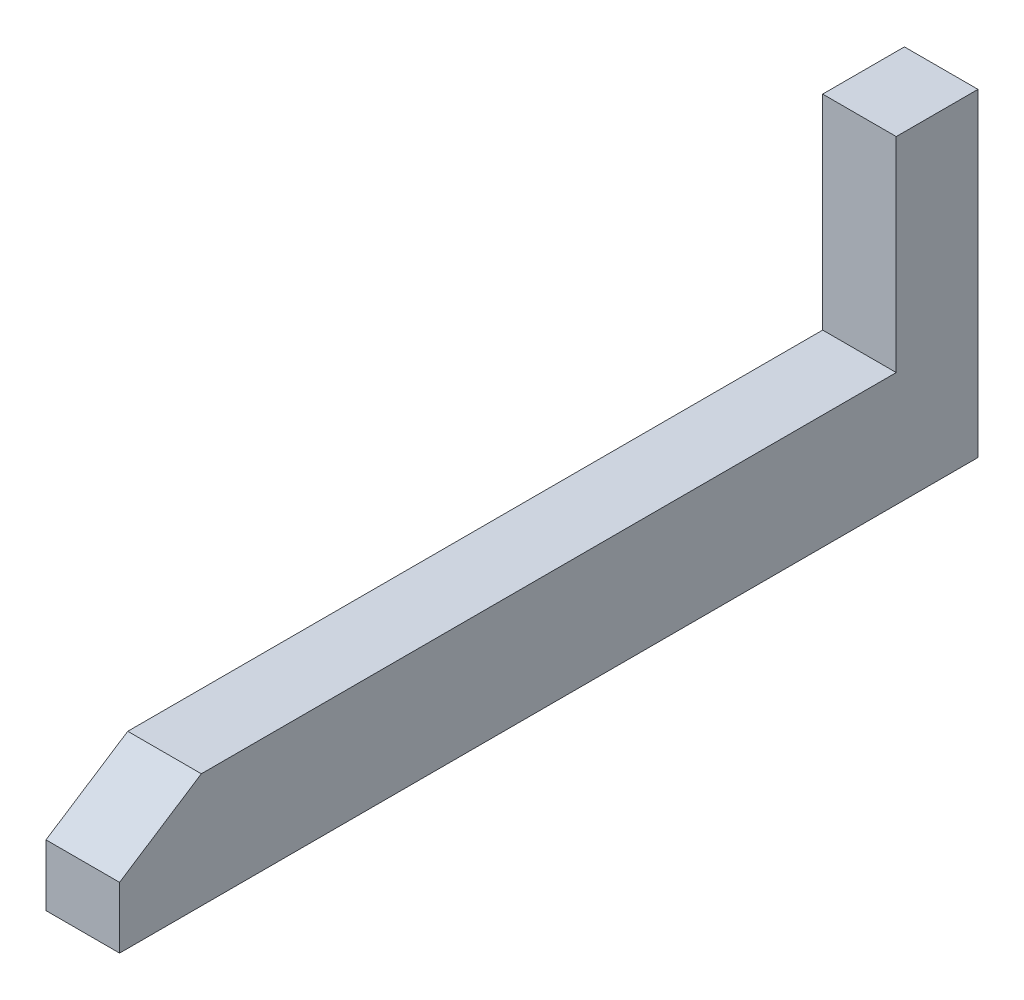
from build123d import *

# Parameters (mm, degrees)
EXTRUDE_1_DEPTH = 1.8


with BuildPart() as part:
    # Sketch 1 → Extrude 1 (new body)
    with BuildSketch(Plane(origin=(0, 0, 0), x_dir=(0, 0, -1), z_dir=(1, 0, 0))):
        Polygon((-7.493860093, 0.928643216), (-9.493860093, -0.371356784), (-9.493860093, -1.871356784), (11.506139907, -1.871356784), (11.506139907, 5.928643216), (9.506139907, 5.928643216), (9.506139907, 0.928643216), align=None)
    extrude(amount=EXTRUDE_1_DEPTH)


solid = part.part
